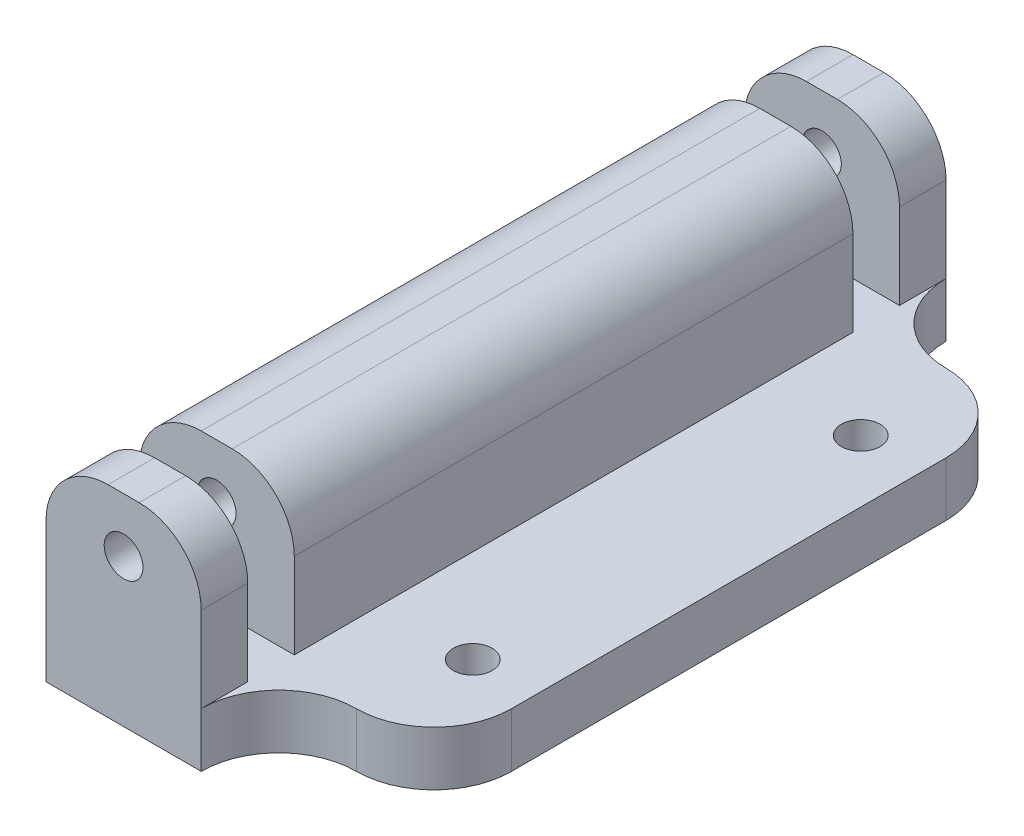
ISO-10303-21;
HEADER;
FILE_DESCRIPTION(('STEP AP214'),'2;1');
FILE_NAME('part.step','',(''),(''),'','','');
FILE_SCHEMA(('AUTOMOTIVE_DESIGN { 1 0 10303 214 1 1 1 1 }'));
ENDSEC;
DATA;
#1=APPLICATION_CONTEXT('core data for automotive mechanical design processes');
#2=APPLICATION_PROTOCOL_DEFINITION('international standard','automotive_design',2000,#1);
#3=PRODUCT_CONTEXT('',#1,'mechanical');
#4=PRODUCT('Part','Part','',(#3));
#5=PRODUCT_RELATED_PRODUCT_CATEGORY('part','',(#4));
#6=PRODUCT_DEFINITION_FORMATION('','',#4);
#7=PRODUCT_DEFINITION_CONTEXT('part definition',#1,'design');
#8=PRODUCT_DEFINITION('design','',#6,#7);
#9=PRODUCT_DEFINITION_SHAPE('','',#8);
#10=(LENGTH_UNIT() NAMED_UNIT(*) SI_UNIT(.MILLI.,.METRE.));
#11=(NAMED_UNIT(*) PLANE_ANGLE_UNIT() SI_UNIT($,.RADIAN.));
#12=(NAMED_UNIT(*) SI_UNIT($,.STERADIAN.) SOLID_ANGLE_UNIT());
#13=UNCERTAINTY_MEASURE_WITH_UNIT(LENGTH_MEASURE(1.E-05),#10,'distance_accuracy_value','');
#14=(GEOMETRIC_REPRESENTATION_CONTEXT(3) GLOBAL_UNCERTAINTY_ASSIGNED_CONTEXT((#13)) GLOBAL_UNIT_ASSIGNED_CONTEXT((#10,
#11,#12)) REPRESENTATION_CONTEXT('',''));
#15=CARTESIAN_POINT('',(0.,0.,0.));
#16=DIRECTION('',(0.,0.,1.));
#17=DIRECTION('',(1.,0.,0.));
#18=AXIS2_PLACEMENT_3D('',#15,#16,#17);
#19=CARTESIAN_POINT('',(6.,9.,48.));
#20=DIRECTION('',(0.,0.,-1.));
#21=DIRECTION('',(-1.,0.,0.));
#22=AXIS2_PLACEMENT_3D('',#19,#20,#21);
#23=PLANE('',#22);
#24=DIRECTION('',(1.,0.,0.));
#25=VECTOR('',#24,1.);
#26=CARTESIAN_POINT('',(0.,0.,48.));
#27=LINE('',#26,#25);
#28=CARTESIAN_POINT('',(0.,0.,48.));
#29=VERTEX_POINT('',#28);
#30=CARTESIAN_POINT('',(10.,0.,48.));
#31=VERTEX_POINT('',#30);
#32=EDGE_CURVE('E280',#29,#31,#27,.T.);
#33=ORIENTED_EDGE('',*,*,#32,.T.);
#34=DIRECTION('',(0.,1.,0.));
#35=VECTOR('',#34,1.);
#36=CARTESIAN_POINT('',(10.,3.5,48.));
#37=LINE('',#36,#35);
#38=CARTESIAN_POINT('',(10.,3.5,48.));
#39=VERTEX_POINT('',#38);
#40=EDGE_CURVE('E285',#31,#39,#37,.T.);
#41=ORIENTED_EDGE('',*,*,#40,.T.);
#42=CARTESIAN_POINT('',(10.,9.,48.));
#43=VERTEX_POINT('',#42);
#44=EDGE_CURVE('E284',#39,#43,#37,.T.);
#45=ORIENTED_EDGE('',*,*,#44,.T.);
#46=CARTESIAN_POINT('',(6.,9.,48.));
#47=DIRECTION('',(0.,0.,1.));
#48=DIRECTION('',(-1.,0.,0.));
#49=AXIS2_PLACEMENT_3D('',#46,#47,#48);
#50=CIRCLE('',#49,4.);
#51=CARTESIAN_POINT('',(6.,13.,48.));
#52=VERTEX_POINT('',#51);
#53=EDGE_CURVE('E288',#43,#52,#50,.T.);
#54=ORIENTED_EDGE('',*,*,#53,.T.);
#55=DIRECTION('',(-1.,0.,0.));
#56=VECTOR('',#55,1.);
#57=CARTESIAN_POINT('',(6.,13.,48.));
#58=LINE('',#57,#56);
#59=CARTESIAN_POINT('',(4.,13.,48.));
#60=VERTEX_POINT('',#59);
#61=EDGE_CURVE('E290',#52,#60,#58,.T.);
#62=ORIENTED_EDGE('',*,*,#61,.T.);
#63=CARTESIAN_POINT('',(4.,9.,48.));
#64=DIRECTION('',(0.,0.,1.));
#65=DIRECTION('',(-1.,0.,0.));
#66=AXIS2_PLACEMENT_3D('',#63,#64,#65);
#67=CIRCLE('',#66,4.);
#68=CARTESIAN_POINT('',(0.,9.,48.));
#69=VERTEX_POINT('',#68);
#70=EDGE_CURVE('E292',#60,#69,#67,.T.);
#71=ORIENTED_EDGE('',*,*,#70,.T.);
#72=DIRECTION('',(0.,-1.,0.));
#73=VECTOR('',#72,1.);
#74=CARTESIAN_POINT('',(0.,9.,48.));
#75=LINE('',#74,#73);
#76=EDGE_CURVE('E277',#69,#29,#75,.T.);
#77=ORIENTED_EDGE('',*,*,#76,.T.);
#78=EDGE_LOOP('',(#33,#41,#45,#54,#62,#71,#77));
#79=FACE_BOUND('',#78,.T.);
#80=CARTESIAN_POINT('',(5.,9.5,48.));
#81=DIRECTION('',(0.,0.,1.));
#82=DIRECTION('',(1.,0.,0.));
#83=AXIS2_PLACEMENT_3D('',#80,#81,#82);
#84=CIRCLE('',#83,1.24999999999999);
#85=CARTESIAN_POINT('',(6.24999999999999,9.5,48.));
#86=VERTEX_POINT('',#85);
#87=EDGE_CURVE('E382',#86,#86,#84,.T.);
#88=ORIENTED_EDGE('',*,*,#87,.F.);
#89=EDGE_LOOP('',(#88));
#90=FACE_BOUND('',#89,.T.);
#91=ADVANCED_FACE('F39',(#79,#90),#23,.F.);
#92=CARTESIAN_POINT('',(10.,3.5,48.));
#93=DIRECTION('',(-1.,0.,0.));
#94=DIRECTION('',(0.,-1.,0.));
#95=AXIS2_PLACEMENT_3D('',#92,#93,#94);
#96=PLANE('',#95);
#97=DIRECTION('',(0.,0.,-1.));
#98=VECTOR('',#97,1.);
#99=CARTESIAN_POINT('',(10.,3.5,48.));
#100=LINE('',#99,#98);
#101=CARTESIAN_POINT('',(10.,3.5,45.));
#102=VERTEX_POINT('',#101);
#103=EDGE_CURVE('E332',#39,#102,#100,.T.);
#104=ORIENTED_EDGE('',*,*,#103,.T.);
#105=DIRECTION('',(0.,1.,0.));
#106=VECTOR('',#105,1.);
#107=CARTESIAN_POINT('',(10.,3.5,45.));
#108=LINE('',#107,#106);
#109=CARTESIAN_POINT('',(10.,9.,45.));
#110=VERTEX_POINT('',#109);
#111=EDGE_CURVE('E238',#102,#110,#108,.T.);
#112=ORIENTED_EDGE('',*,*,#111,.T.);
#113=DIRECTION('',(0.,0.,-1.));
#114=VECTOR('',#113,1.);
#115=CARTESIAN_POINT('',(10.,9.,48.));
#116=LINE('',#115,#114);
#117=EDGE_CURVE('E327',#43,#110,#116,.T.);
#118=ORIENTED_EDGE('',*,*,#117,.F.);
#119=ORIENTED_EDGE('',*,*,#44,.F.);
#120=EDGE_LOOP('',(#104,#112,#118,#119));
#121=FACE_BOUND('',#120,.T.);
#122=ADVANCED_FACE('F420',(#121),#96,.F.);
#123=CARTESIAN_POINT('',(6.,9.,48.));
#124=DIRECTION('',(0.,0.,-1.));
#125=DIRECTION('',(-1.,0.,0.));
#126=AXIS2_PLACEMENT_3D('',#123,#124,#125);
#127=CYLINDRICAL_SURFACE('',#126,4.);
#128=ORIENTED_EDGE('',*,*,#117,.T.);
#129=CARTESIAN_POINT('',(6.,9.,45.));
#130=DIRECTION('',(0.,0.,1.));
#131=DIRECTION('',(1.,0.,0.));
#132=AXIS2_PLACEMENT_3D('',#129,#130,#131);
#133=CIRCLE('',#132,4.);
#134=CARTESIAN_POINT('',(6.,13.,45.));
#135=VERTEX_POINT('',#134);
#136=EDGE_CURVE('E235',#110,#135,#133,.T.);
#137=ORIENTED_EDGE('',*,*,#136,.T.);
#138=DIRECTION('',(0.,0.,-1.));
#139=VECTOR('',#138,1.);
#140=CARTESIAN_POINT('',(6.,13.,48.));
#141=LINE('',#140,#139);
#142=EDGE_CURVE('E322',#52,#135,#141,.T.);
#143=ORIENTED_EDGE('',*,*,#142,.F.);
#144=ORIENTED_EDGE('',*,*,#53,.F.);
#145=EDGE_LOOP('',(#128,#137,#143,#144));
#146=FACE_BOUND('',#145,.T.);
#147=ADVANCED_FACE('F426',(#146),#127,.T.);
#148=CARTESIAN_POINT('',(6.,13.,48.));
#149=DIRECTION('',(0.,-1.,0.));
#150=DIRECTION('',(0.,0.,-1.));
#151=AXIS2_PLACEMENT_3D('',#148,#149,#150);
#152=PLANE('',#151);
#153=ORIENTED_EDGE('',*,*,#142,.T.);
#154=DIRECTION('',(-1.,0.,0.));
#155=VECTOR('',#154,1.);
#156=CARTESIAN_POINT('',(60.,13.,45.));
#157=LINE('',#156,#155);
#158=CARTESIAN_POINT('',(4.,13.,45.));
#159=VERTEX_POINT('',#158);
#160=EDGE_CURVE('E221',#135,#159,#157,.T.);
#161=ORIENTED_EDGE('',*,*,#160,.T.);
#162=DIRECTION('',(0.,0.,-1.));
#163=VECTOR('',#162,1.);
#164=CARTESIAN_POINT('',(4.,13.,48.));
#165=LINE('',#164,#163);
#166=EDGE_CURVE('E317',#60,#159,#165,.T.);
#167=ORIENTED_EDGE('',*,*,#166,.F.);
#168=ORIENTED_EDGE('',*,*,#61,.F.);
#169=EDGE_LOOP('',(#153,#161,#167,#168));
#170=FACE_BOUND('',#169,.T.);
#171=ADVANCED_FACE('F451',(#170),#152,.F.);
#172=CARTESIAN_POINT('',(4.,9.,48.));
#173=DIRECTION('',(0.,0.,-1.));
#174=DIRECTION('',(-1.,0.,0.));
#175=AXIS2_PLACEMENT_3D('',#172,#173,#174);
#176=CYLINDRICAL_SURFACE('',#175,4.);
#177=ORIENTED_EDGE('',*,*,#166,.T.);
#178=CARTESIAN_POINT('',(4.,9.,45.));
#179=DIRECTION('',(0.,0.,1.));
#180=DIRECTION('',(1.,0.,0.));
#181=AXIS2_PLACEMENT_3D('',#178,#179,#180);
#182=CIRCLE('',#181,4.);
#183=CARTESIAN_POINT('',(0.,9.,45.));
#184=VERTEX_POINT('',#183);
#185=EDGE_CURVE('E232',#159,#184,#182,.T.);
#186=ORIENTED_EDGE('',*,*,#185,.T.);
#187=DIRECTION('',(0.,0.,-1.));
#188=VECTOR('',#187,1.);
#189=CARTESIAN_POINT('',(0.,9.,48.));
#190=LINE('',#189,#188);
#191=EDGE_CURVE('E314',#69,#184,#190,.T.);
#192=ORIENTED_EDGE('',*,*,#191,.F.);
#193=ORIENTED_EDGE('',*,*,#70,.F.);
#194=EDGE_LOOP('',(#177,#186,#192,#193));
#195=FACE_BOUND('',#194,.T.);
#196=ADVANCED_FACE('F445',(#195),#176,.T.);
#197=CARTESIAN_POINT('',(10.,9.,3.));
#198=VERTEX_POINT('',#197);
#199=CARTESIAN_POINT('',(10.,9.,0.));
#200=VERTEX_POINT('',#199);
#201=EDGE_CURVE('E325',#198,#200,#116,.T.);
#202=ORIENTED_EDGE('',*,*,#201,.F.);
#203=DIRECTION('',(0.,-1.,0.));
#204=VECTOR('',#203,1.);
#205=CARTESIAN_POINT('',(10.,3.50000000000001,3.));
#206=LINE('',#205,#204);
#207=CARTESIAN_POINT('',(10.,3.5,3.));
#208=VERTEX_POINT('',#207);
#209=EDGE_CURVE('E273',#198,#208,#206,.T.);
#210=ORIENTED_EDGE('',*,*,#209,.T.);
#211=CARTESIAN_POINT('',(10.,3.5,0.));
#212=VERTEX_POINT('',#211);
#213=EDGE_CURVE('E330',#208,#212,#100,.T.);
#214=ORIENTED_EDGE('',*,*,#213,.T.);
#215=DIRECTION('',(0.,1.,0.));
#216=VECTOR('',#215,1.);
#217=CARTESIAN_POINT('',(10.,3.5,0.));
#218=LINE('',#217,#216);
#219=EDGE_CURVE('E302',#212,#200,#218,.T.);
#220=ORIENTED_EDGE('',*,*,#219,.T.);
#221=EDGE_LOOP('',(#202,#210,#214,#220));
#222=FACE_BOUND('',#221,.T.);
#223=ADVANCED_FACE('F429',(#222),#96,.F.);
#224=CARTESIAN_POINT('',(6.,13.,3.));
#225=VERTEX_POINT('',#224);
#226=CARTESIAN_POINT('',(6.,13.,0.));
#227=VERTEX_POINT('',#226);
#228=EDGE_CURVE('E320',#225,#227,#141,.T.);
#229=ORIENTED_EDGE('',*,*,#228,.F.);
#230=CARTESIAN_POINT('',(6.,9.,3.));
#231=DIRECTION('',(0.,0.,-1.));
#232=DIRECTION('',(0.,1.,0.));
#233=AXIS2_PLACEMENT_3D('',#230,#231,#232);
#234=CIRCLE('',#233,4.);
#235=EDGE_CURVE('E270',#225,#198,#234,.T.);
#236=ORIENTED_EDGE('',*,*,#235,.T.);
#237=ORIENTED_EDGE('',*,*,#201,.T.);
#238=CARTESIAN_POINT('',(6.,9.,0.));
#239=DIRECTION('',(0.,0.,1.));
#240=DIRECTION('',(-1.,0.,0.));
#241=AXIS2_PLACEMENT_3D('',#238,#239,#240);
#242=CIRCLE('',#241,4.);
#243=EDGE_CURVE('E306',#200,#227,#242,.T.);
#244=ORIENTED_EDGE('',*,*,#243,.T.);
#245=EDGE_LOOP('',(#229,#236,#237,#244));
#246=FACE_BOUND('',#245,.T.);
#247=ADVANCED_FACE('F455',(#246),#127,.T.);
#248=CARTESIAN_POINT('',(4.,13.,3.));
#249=VERTEX_POINT('',#248);
#250=CARTESIAN_POINT('',(4.,13.,0.));
#251=VERTEX_POINT('',#250);
#252=EDGE_CURVE('E316',#249,#251,#165,.T.);
#253=ORIENTED_EDGE('',*,*,#252,.F.);
#254=DIRECTION('',(-1.,0.,0.));
#255=VECTOR('',#254,1.);
#256=CARTESIAN_POINT('',(60.,13.,3.));
#257=LINE('',#256,#255);
#258=EDGE_CURVE('E249',#225,#249,#257,.T.);
#259=ORIENTED_EDGE('',*,*,#258,.F.);
#260=ORIENTED_EDGE('',*,*,#228,.T.);
#261=DIRECTION('',(-1.,0.,0.));
#262=VECTOR('',#261,1.);
#263=CARTESIAN_POINT('',(6.,13.,0.));
#264=LINE('',#263,#262);
#265=EDGE_CURVE('E309',#227,#251,#264,.T.);
#266=ORIENTED_EDGE('',*,*,#265,.T.);
#267=EDGE_LOOP('',(#253,#259,#260,#266));
#268=FACE_BOUND('',#267,.T.);
#269=ADVANCED_FACE('F452',(#268),#152,.F.);
#270=CARTESIAN_POINT('',(0.,9.,3.));
#271=VERTEX_POINT('',#270);
#272=CARTESIAN_POINT('',(0.,9.,0.));
#273=VERTEX_POINT('',#272);
#274=EDGE_CURVE('E294',#271,#273,#190,.T.);
#275=ORIENTED_EDGE('',*,*,#274,.F.);
#276=CARTESIAN_POINT('',(4.,9.,3.));
#277=DIRECTION('',(0.,0.,-1.));
#278=DIRECTION('',(0.,1.,0.));
#279=AXIS2_PLACEMENT_3D('',#276,#277,#278);
#280=CIRCLE('',#279,4.);
#281=EDGE_CURVE('E267',#271,#249,#280,.T.);
#282=ORIENTED_EDGE('',*,*,#281,.T.);
#283=ORIENTED_EDGE('',*,*,#252,.T.);
#284=CARTESIAN_POINT('',(4.,9.,0.));
#285=DIRECTION('',(0.,0.,1.));
#286=DIRECTION('',(-1.,0.,0.));
#287=AXIS2_PLACEMENT_3D('',#284,#285,#286);
#288=CIRCLE('',#287,4.);
#289=EDGE_CURVE('E281',#251,#273,#288,.T.);
#290=ORIENTED_EDGE('',*,*,#289,.T.);
#291=EDGE_LOOP('',(#275,#282,#283,#290));
#292=FACE_BOUND('',#291,.T.);
#293=ADVANCED_FACE('F446',(#292),#176,.T.);
#294=CARTESIAN_POINT('',(0.,9.,48.));
#295=DIRECTION('',(1.,0.,0.));
#296=DIRECTION('',(0.,0.,-1.));
#297=AXIS2_PLACEMENT_3D('',#294,#295,#296);
#298=PLANE('',#297);
#299=ORIENTED_EDGE('',*,*,#191,.T.);
#300=DIRECTION('',(0.,1.,0.));
#301=VECTOR('',#300,1.);
#302=CARTESIAN_POINT('',(0.,13.,45.));
#303=LINE('',#302,#301);
#304=CARTESIAN_POINT('',(0.,3.5,45.));
#305=VERTEX_POINT('',#304);
#306=EDGE_CURVE('E216',#305,#184,#303,.T.);
#307=ORIENTED_EDGE('',*,*,#306,.F.);
#308=DIRECTION('',(0.,0.,1.));
#309=VECTOR('',#308,1.);
#310=CARTESIAN_POINT('',(0.,3.5,45.));
#311=LINE('',#310,#309);
#312=CARTESIAN_POINT('',(0.,3.5,42.));
#313=VERTEX_POINT('',#312);
#314=EDGE_CURVE('E201',#313,#305,#311,.T.);
#315=ORIENTED_EDGE('',*,*,#314,.F.);
#316=DIRECTION('',(0.,-1.,0.));
#317=VECTOR('',#316,1.);
#318=CARTESIAN_POINT('',(0.,13.,42.));
#319=LINE('',#318,#317);
#320=CARTESIAN_POINT('',(0.,9.,42.));
#321=VERTEX_POINT('',#320);
#322=EDGE_CURVE('E194',#321,#313,#319,.T.);
#323=ORIENTED_EDGE('',*,*,#322,.F.);
#324=CARTESIAN_POINT('',(0.,9.,6.00000000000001));
#325=VERTEX_POINT('',#324);
#326=EDGE_CURVE('E64',#321,#325,#190,.T.);
#327=ORIENTED_EDGE('',*,*,#326,.T.);
#328=DIRECTION('',(0.,1.,0.));
#329=VECTOR('',#328,1.);
#330=CARTESIAN_POINT('',(0.,13.,6.));
#331=LINE('',#330,#329);
#332=CARTESIAN_POINT('',(0.,3.5,6.));
#333=VERTEX_POINT('',#332);
#334=EDGE_CURVE('E246',#333,#325,#331,.T.);
#335=ORIENTED_EDGE('',*,*,#334,.F.);
#336=DIRECTION('',(0.,0.,1.));
#337=VECTOR('',#336,1.);
#338=CARTESIAN_POINT('',(0.,3.5,3.));
#339=LINE('',#338,#337);
#340=CARTESIAN_POINT('',(0.,3.5,3.));
#341=VERTEX_POINT('',#340);
#342=EDGE_CURVE('E243',#341,#333,#339,.T.);
#343=ORIENTED_EDGE('',*,*,#342,.F.);
#344=DIRECTION('',(0.,-1.,0.));
#345=VECTOR('',#344,1.);
#346=CARTESIAN_POINT('',(0.,13.,3.));
#347=LINE('',#346,#345);
#348=EDGE_CURVE('E241',#271,#341,#347,.T.);
#349=ORIENTED_EDGE('',*,*,#348,.F.);
#350=ORIENTED_EDGE('',*,*,#274,.T.);
#351=DIRECTION('',(0.,-1.,0.));
#352=VECTOR('',#351,1.);
#353=CARTESIAN_POINT('',(0.,9.,0.));
#354=LINE('',#353,#352);
#355=CARTESIAN_POINT('',(0.,0.,0.));
#356=VERTEX_POINT('',#355);
#357=EDGE_CURVE('E295',#273,#356,#354,.T.);
#358=ORIENTED_EDGE('',*,*,#357,.T.);
#359=DIRECTION('',(0.,0.,-1.));
#360=VECTOR('',#359,1.);
#361=CARTESIAN_POINT('',(0.,0.,48.));
#362=LINE('',#361,#360);
#363=EDGE_CURVE('E341',#29,#356,#362,.T.);
#364=ORIENTED_EDGE('',*,*,#363,.F.);
#365=ORIENTED_EDGE('',*,*,#76,.F.);
#366=EDGE_LOOP('',(#299,#307,#315,#323,#327,#335,#343,#349,#350,#358,#364,#365));
#367=FACE_BOUND('',#366,.T.);
#368=ADVANCED_FACE('F215',(#367),#298,.F.);
#369=CARTESIAN_POINT('',(0.,0.,48.));
#370=DIRECTION('',(0.,1.,0.));
#371=DIRECTION('',(0.,0.,1.));
#372=AXIS2_PLACEMENT_3D('',#369,#370,#371);
#373=PLANE('',#372);
#374=CARTESIAN_POINT('',(16.,0.,36.5));
#375=DIRECTION('',(0.,1.,0.));
#376=DIRECTION('',(0.,0.,1.));
#377=AXIS2_PLACEMENT_3D('',#374,#375,#376);
#378=CIRCLE('',#377,1.25);
#379=CARTESIAN_POINT('',(16.,0.,37.75));
#380=VERTEX_POINT('',#379);
#381=EDGE_CURVE('E786',#380,#380,#378,.T.);
#382=ORIENTED_EDGE('',*,*,#381,.T.);
#383=EDGE_LOOP('',(#382));
#384=FACE_BOUND('',#383,.T.);
#385=CARTESIAN_POINT('',(16.,0.,11.5));
#386=DIRECTION('',(0.,1.,0.));
#387=DIRECTION('',(0.,0.,1.));
#388=AXIS2_PLACEMENT_3D('',#385,#386,#387);
#389=CIRCLE('',#388,1.25);
#390=CARTESIAN_POINT('',(16.,0.,12.75));
#391=VERTEX_POINT('',#390);
#392=EDGE_CURVE('E387',#391,#391,#389,.T.);
#393=ORIENTED_EDGE('',*,*,#392,.T.);
#394=EDGE_LOOP('',(#393));
#395=FACE_BOUND('',#394,.T.);
#396=DIRECTION('',(0.,0.,-1.));
#397=VECTOR('',#396,1.);
#398=CARTESIAN_POINT('',(20.,0.,48.));
#399=LINE('',#398,#397);
#400=CARTESIAN_POINT('',(20.,0.,38.));
#401=VERTEX_POINT('',#400);
#402=CARTESIAN_POINT('',(20.,0.,9.99999999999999));
#403=VERTEX_POINT('',#402);
#404=EDGE_CURVE('E338',#401,#403,#399,.T.);
#405=ORIENTED_EDGE('',*,*,#404,.F.);
#406=CARTESIAN_POINT('',(15.,0.,38.));
#407=DIRECTION('',(0.,1.,0.));
#408=DIRECTION('',(0.,0.,1.));
#409=AXIS2_PLACEMENT_3D('',#406,#407,#408);
#410=CIRCLE('',#409,5.);
#411=CARTESIAN_POINT('',(15.,0.,43.));
#412=VERTEX_POINT('',#411);
#413=EDGE_CURVE('E356',#401,#412,#410,.F.);
#414=ORIENTED_EDGE('',*,*,#413,.T.);
#415=CARTESIAN_POINT('',(15.,0.,48.));
#416=DIRECTION('',(0.,1.,0.));
#417=DIRECTION('',(0.,0.,1.));
#418=AXIS2_PLACEMENT_3D('',#415,#416,#417);
#419=CIRCLE('',#418,5.);
#420=EDGE_CURVE('E360',#412,#31,#419,.T.);
#421=ORIENTED_EDGE('',*,*,#420,.T.);
#422=ORIENTED_EDGE('',*,*,#32,.F.);
#423=ORIENTED_EDGE('',*,*,#363,.T.);
#424=DIRECTION('',(1.,0.,0.));
#425=VECTOR('',#424,1.);
#426=CARTESIAN_POINT('',(0.,0.,0.));
#427=LINE('',#426,#425);
#428=CARTESIAN_POINT('',(10.,0.,0.));
#429=VERTEX_POINT('',#428);
#430=EDGE_CURVE('E298',#356,#429,#427,.T.);
#431=ORIENTED_EDGE('',*,*,#430,.T.);
#432=CARTESIAN_POINT('',(15.,0.,0.));
#433=DIRECTION('',(0.,1.,0.));
#434=DIRECTION('',(0.,0.,1.));
#435=AXIS2_PLACEMENT_3D('',#432,#433,#434);
#436=CIRCLE('',#435,5.);
#437=CARTESIAN_POINT('',(15.,0.,5.));
#438=VERTEX_POINT('',#437);
#439=EDGE_CURVE('E12',#429,#438,#436,.T.);
#440=ORIENTED_EDGE('',*,*,#439,.T.);
#441=CARTESIAN_POINT('',(15.,0.,9.99999999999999));
#442=DIRECTION('',(0.,1.,0.));
#443=DIRECTION('',(0.,0.,1.));
#444=AXIS2_PLACEMENT_3D('',#441,#442,#443);
#445=CIRCLE('',#444,5.);
#446=EDGE_CURVE('E354',#438,#403,#445,.F.);
#447=ORIENTED_EDGE('',*,*,#446,.T.);
#448=EDGE_LOOP('',(#405,#414,#421,#422,#423,#431,#440,#447));
#449=FACE_BOUND('',#448,.T.);
#450=ADVANCED_FACE('F465',(#384,#395,#449),#373,.F.);
#451=CARTESIAN_POINT('',(20.,0.,48.));
#452=DIRECTION('',(-1.,0.,0.));
#453=DIRECTION('',(0.,0.,1.));
#454=AXIS2_PLACEMENT_3D('',#451,#452,#453);
#455=PLANE('',#454);
#456=DIRECTION('',(0.,0.,-1.));
#457=VECTOR('',#456,1.);
#458=CARTESIAN_POINT('',(20.,3.5,48.));
#459=LINE('',#458,#457);
#460=CARTESIAN_POINT('',(20.,3.5,38.));
#461=VERTEX_POINT('',#460);
#462=CARTESIAN_POINT('',(20.,3.5,9.99999999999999));
#463=VERTEX_POINT('',#462);
#464=EDGE_CURVE('E335',#461,#463,#459,.T.);
#465=ORIENTED_EDGE('',*,*,#464,.F.);
#466=DIRECTION('',(0.,1.,0.));
#467=VECTOR('',#466,1.);
#468=CARTESIAN_POINT('',(20.,0.,38.));
#469=LINE('',#468,#467);
#470=EDGE_CURVE('E351',#461,#401,#469,.F.);
#471=ORIENTED_EDGE('',*,*,#470,.T.);
#472=ORIENTED_EDGE('',*,*,#404,.T.);
#473=DIRECTION('',(0.,1.,0.));
#474=VECTOR('',#473,1.);
#475=CARTESIAN_POINT('',(20.,0.,9.99999999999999));
#476=LINE('',#475,#474);
#477=EDGE_CURVE('E348',#403,#463,#476,.T.);
#478=ORIENTED_EDGE('',*,*,#477,.T.);
#479=EDGE_LOOP('',(#465,#471,#472,#478));
#480=FACE_BOUND('',#479,.T.);
#481=ADVANCED_FACE('F461',(#480),#455,.F.);
#482=CARTESIAN_POINT('',(20.,3.5,48.));
#483=DIRECTION('',(0.,-1.,0.));
#484=DIRECTION('',(1.,0.,0.));
#485=AXIS2_PLACEMENT_3D('',#482,#483,#484);
#486=PLANE('',#485);
#487=CARTESIAN_POINT('',(16.,3.5,36.5));
#488=DIRECTION('',(0.,1.,0.));
#489=DIRECTION('',(0.,0.,1.));
#490=AXIS2_PLACEMENT_3D('',#487,#488,#489);
#491=CIRCLE('',#490,1.24999999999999);
#492=CARTESIAN_POINT('',(16.,3.5,37.75));
#493=VERTEX_POINT('',#492);
#494=EDGE_CURVE('E789',#493,#493,#491,.T.);
#495=ORIENTED_EDGE('',*,*,#494,.F.);
#496=EDGE_LOOP('',(#495));
#497=FACE_BOUND('',#496,.T.);
#498=CARTESIAN_POINT('',(16.,3.5,11.5));
#499=DIRECTION('',(0.,1.,0.));
#500=DIRECTION('',(0.,0.,1.));
#501=AXIS2_PLACEMENT_3D('',#498,#499,#500);
#502=CIRCLE('',#501,1.24999999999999);
#503=CARTESIAN_POINT('',(16.,3.5,12.75));
#504=VERTEX_POINT('',#503);
#505=EDGE_CURVE('E791',#504,#504,#502,.T.);
#506=ORIENTED_EDGE('',*,*,#505,.F.);
#507=EDGE_LOOP('',(#506));
#508=FACE_BOUND('',#507,.T.);
#509=CARTESIAN_POINT('',(10.,3.5,42.));
#510=VERTEX_POINT('',#509);
#511=CARTESIAN_POINT('',(10.,3.5,6.));
#512=VERTEX_POINT('',#511);
#513=EDGE_CURVE('E211',#510,#512,#100,.T.);
#514=ORIENTED_EDGE('',*,*,#513,.F.);
#515=DIRECTION('',(-1.,0.,0.));
#516=VECTOR('',#515,1.);
#517=CARTESIAN_POINT('',(60.,3.5,42.));
#518=LINE('',#517,#516);
#519=EDGE_CURVE('E197',#510,#313,#518,.T.);
#520=ORIENTED_EDGE('',*,*,#519,.T.);
#521=ORIENTED_EDGE('',*,*,#314,.T.);
#522=DIRECTION('',(-1.,0.,0.));
#523=VECTOR('',#522,1.);
#524=CARTESIAN_POINT('',(60.,3.5,45.));
#525=LINE('',#524,#523);
#526=EDGE_CURVE('E212',#102,#305,#525,.T.);
#527=ORIENTED_EDGE('',*,*,#526,.F.);
#528=ORIENTED_EDGE('',*,*,#103,.F.);
#529=CARTESIAN_POINT('',(15.,3.5,48.));
#530=DIRECTION('',(0.,-1.,0.));
#531=DIRECTION('',(1.,0.,0.));
#532=AXIS2_PLACEMENT_3D('',#529,#530,#531);
#533=CIRCLE('',#532,5.);
#534=CARTESIAN_POINT('',(15.,3.5,43.));
#535=VERTEX_POINT('',#534);
#536=EDGE_CURVE('E358',#39,#535,#533,.T.);
#537=ORIENTED_EDGE('',*,*,#536,.T.);
#538=CARTESIAN_POINT('',(15.,3.5,38.));
#539=DIRECTION('',(0.,-1.,0.));
#540=DIRECTION('',(1.,0.,0.));
#541=AXIS2_PLACEMENT_3D('',#538,#539,#540);
#542=CIRCLE('',#541,5.);
#543=EDGE_CURVE('E346',#535,#461,#542,.F.);
#544=ORIENTED_EDGE('',*,*,#543,.T.);
#545=ORIENTED_EDGE('',*,*,#464,.T.);
#546=CARTESIAN_POINT('',(15.,3.5,9.99999999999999));
#547=DIRECTION('',(0.,-1.,0.));
#548=DIRECTION('',(1.,0.,0.));
#549=AXIS2_PLACEMENT_3D('',#546,#547,#548);
#550=CIRCLE('',#549,5.);
#551=CARTESIAN_POINT('',(15.,3.5,5.));
#552=VERTEX_POINT('',#551);
#553=EDGE_CURVE('E344',#463,#552,#550,.F.);
#554=ORIENTED_EDGE('',*,*,#553,.T.);
#555=CARTESIAN_POINT('',(15.,3.5,0.));
#556=DIRECTION('',(0.,-1.,0.));
#557=DIRECTION('',(1.,0.,0.));
#558=AXIS2_PLACEMENT_3D('',#555,#556,#557);
#559=CIRCLE('',#558,5.);
#560=EDGE_CURVE('E48',#552,#212,#559,.T.);
#561=ORIENTED_EDGE('',*,*,#560,.T.);
#562=ORIENTED_EDGE('',*,*,#213,.F.);
#563=DIRECTION('',(-1.,0.,0.));
#564=VECTOR('',#563,1.);
#565=CARTESIAN_POINT('',(60.,3.5,3.));
#566=LINE('',#565,#564);
#567=EDGE_CURVE('E248',#208,#341,#566,.T.);
#568=ORIENTED_EDGE('',*,*,#567,.T.);
#569=ORIENTED_EDGE('',*,*,#342,.T.);
#570=DIRECTION('',(-1.,0.,0.));
#571=VECTOR('',#570,1.);
#572=CARTESIAN_POINT('',(60.,3.5,6.));
#573=LINE('',#572,#571);
#574=EDGE_CURVE('E255',#512,#333,#573,.T.);
#575=ORIENTED_EDGE('',*,*,#574,.F.);
#576=EDGE_LOOP('',(#514,#520,#521,#527,#528,#537,#544,#545,#554,#561,#562,#568,#569,#575));
#577=FACE_BOUND('',#576,.T.);
#578=ADVANCED_FACE('F207',(#497,#508,#577),#486,.F.);
#579=CARTESIAN_POINT('',(10.,9.,42.));
#580=VERTEX_POINT('',#579);
#581=CARTESIAN_POINT('',(10.,9.,6.00000000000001));
#582=VERTEX_POINT('',#581);
#583=EDGE_CURVE('E331',#580,#582,#116,.T.);
#584=ORIENTED_EDGE('',*,*,#583,.F.);
#585=DIRECTION('',(0.,-1.,0.));
#586=VECTOR('',#585,1.);
#587=CARTESIAN_POINT('',(10.,3.5,42.));
#588=LINE('',#587,#586);
#589=EDGE_CURVE('E230',#580,#510,#588,.T.);
#590=ORIENTED_EDGE('',*,*,#589,.T.);
#591=ORIENTED_EDGE('',*,*,#513,.T.);
#592=DIRECTION('',(0.,1.,0.));
#593=VECTOR('',#592,1.);
#594=CARTESIAN_POINT('',(10.,3.50000000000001,6.00000000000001));
#595=LINE('',#594,#593);
#596=EDGE_CURVE('E264',#512,#582,#595,.T.);
#597=ORIENTED_EDGE('',*,*,#596,.T.);
#598=EDGE_LOOP('',(#584,#590,#591,#597));
#599=FACE_BOUND('',#598,.T.);
#600=ADVANCED_FACE('F430',(#599),#96,.F.);
#601=CARTESIAN_POINT('',(6.,13.,42.));
#602=VERTEX_POINT('',#601);
#603=CARTESIAN_POINT('',(6.,13.,6.));
#604=VERTEX_POINT('',#603);
#605=EDGE_CURVE('E326',#602,#604,#141,.T.);
#606=ORIENTED_EDGE('',*,*,#605,.F.);
#607=CARTESIAN_POINT('',(6.,9.,42.));
#608=DIRECTION('',(0.,0.,-1.));
#609=DIRECTION('',(-1.,0.,0.));
#610=AXIS2_PLACEMENT_3D('',#607,#608,#609);
#611=CIRCLE('',#610,4.);
#612=EDGE_CURVE('E227',#602,#580,#611,.T.);
#613=ORIENTED_EDGE('',*,*,#612,.T.);
#614=ORIENTED_EDGE('',*,*,#583,.T.);
#615=CARTESIAN_POINT('',(6.,9.,6.00000000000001));
#616=DIRECTION('',(0.,0.,1.));
#617=DIRECTION('',(0.,-1.,0.));
#618=AXIS2_PLACEMENT_3D('',#615,#616,#617);
#619=CIRCLE('',#618,4.);
#620=EDGE_CURVE('E261',#582,#604,#619,.T.);
#621=ORIENTED_EDGE('',*,*,#620,.T.);
#622=EDGE_LOOP('',(#606,#613,#614,#621));
#623=FACE_BOUND('',#622,.T.);
#624=ADVANCED_FACE('F449',(#623),#127,.T.);
#625=CARTESIAN_POINT('',(4.,13.,42.));
#626=VERTEX_POINT('',#625);
#627=CARTESIAN_POINT('',(4.,13.,6.00000000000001));
#628=VERTEX_POINT('',#627);
#629=EDGE_CURVE('E321',#626,#628,#165,.T.);
#630=ORIENTED_EDGE('',*,*,#629,.F.);
#631=DIRECTION('',(-1.,0.,0.));
#632=VECTOR('',#631,1.);
#633=CARTESIAN_POINT('',(60.,13.,42.));
#634=LINE('',#633,#632);
#635=EDGE_CURVE('E56',#602,#626,#634,.T.);
#636=ORIENTED_EDGE('',*,*,#635,.F.);
#637=ORIENTED_EDGE('',*,*,#605,.T.);
#638=DIRECTION('',(-1.,0.,0.));
#639=VECTOR('',#638,1.);
#640=CARTESIAN_POINT('',(60.,13.,6.));
#641=LINE('',#640,#639);
#642=EDGE_CURVE('E252',#604,#628,#641,.T.);
#643=ORIENTED_EDGE('',*,*,#642,.T.);
#644=EDGE_LOOP('',(#630,#636,#637,#643));
#645=FACE_BOUND('',#644,.T.);
#646=ADVANCED_FACE('F443',(#645),#152,.F.);
#647=ORIENTED_EDGE('',*,*,#326,.F.);
#648=CARTESIAN_POINT('',(4.,9.,42.));
#649=DIRECTION('',(0.,0.,-1.));
#650=DIRECTION('',(-1.,0.,0.));
#651=AXIS2_PLACEMENT_3D('',#648,#649,#650);
#652=CIRCLE('',#651,4.);
#653=EDGE_CURVE('E199',#321,#626,#652,.T.);
#654=ORIENTED_EDGE('',*,*,#653,.T.);
#655=ORIENTED_EDGE('',*,*,#629,.T.);
#656=CARTESIAN_POINT('',(4.,9.,6.00000000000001));
#657=DIRECTION('',(0.,0.,1.));
#658=DIRECTION('',(0.,-1.,0.));
#659=AXIS2_PLACEMENT_3D('',#656,#657,#658);
#660=CIRCLE('',#659,4.);
#661=EDGE_CURVE('E251',#628,#325,#660,.T.);
#662=ORIENTED_EDGE('',*,*,#661,.T.);
#663=EDGE_LOOP('',(#647,#654,#655,#662));
#664=FACE_BOUND('',#663,.T.);
#665=ADVANCED_FACE('F439',(#664),#176,.T.);
#666=CARTESIAN_POINT('',(6.,9.,0.));
#667=DIRECTION('',(0.,0.,-1.));
#668=DIRECTION('',(-1.,0.,0.));
#669=AXIS2_PLACEMENT_3D('',#666,#667,#668);
#670=PLANE('',#669);
#671=CARTESIAN_POINT('',(5.,9.5,0.));
#672=DIRECTION('',(0.,0.,-1.));
#673=DIRECTION('',(-1.,0.,0.));
#674=AXIS2_PLACEMENT_3D('',#671,#672,#673);
#675=CIRCLE('',#674,1.25);
#676=CARTESIAN_POINT('',(3.75,9.5,0.));
#677=VERTEX_POINT('',#676);
#678=EDGE_CURVE('E391',#677,#677,#675,.T.);
#679=ORIENTED_EDGE('',*,*,#678,.F.);
#680=EDGE_LOOP('',(#679));
#681=FACE_BOUND('',#680,.T.);
#682=EDGE_CURVE('E303',#429,#212,#218,.T.);
#683=ORIENTED_EDGE('',*,*,#682,.F.);
#684=ORIENTED_EDGE('',*,*,#430,.F.);
#685=ORIENTED_EDGE('',*,*,#357,.F.);
#686=ORIENTED_EDGE('',*,*,#289,.F.);
#687=ORIENTED_EDGE('',*,*,#265,.F.);
#688=ORIENTED_EDGE('',*,*,#243,.F.);
#689=ORIENTED_EDGE('',*,*,#219,.F.);
#690=EDGE_LOOP('',(#683,#684,#685,#686,#687,#688,#689));
#691=FACE_BOUND('',#690,.T.);
#692=ADVANCED_FACE('F436',(#681,#691),#670,.T.);
#693=CARTESIAN_POINT('',(5.,9.5,60.));
#694=DIRECTION('',(0.,0.,-1.));
#695=DIRECTION('',(-1.,0.,0.));
#696=AXIS2_PLACEMENT_3D('',#693,#694,#695);
#697=CYLINDRICAL_SURFACE('',#696,1.);
#698=CARTESIAN_POINT('',(5.,9.5,33.));
#699=DIRECTION('',(0.,0.,-1.));
#700=DIRECTION('',(-1.,0.,0.));
#701=AXIS2_PLACEMENT_3D('',#698,#699,#700);
#702=CIRCLE('',#701,1.);
#703=CARTESIAN_POINT('',(4.,9.5,33.));
#704=VERTEX_POINT('',#703);
#705=EDGE_CURVE('E43',#704,#704,#702,.F.);
#706=ORIENTED_EDGE('',*,*,#705,.T.);
#707=EDGE_LOOP('',(#706));
#708=FACE_BOUND('',#707,.T.);
#709=CARTESIAN_POINT('',(5.,9.5,15.));
#710=DIRECTION('',(0.,0.,1.));
#711=DIRECTION('',(1.,0.,0.));
#712=AXIS2_PLACEMENT_3D('',#709,#710,#711);
#713=CIRCLE('',#712,1.);
#714=CARTESIAN_POINT('',(6.,9.5,15.));
#715=VERTEX_POINT('',#714);
#716=EDGE_CURVE('E202',#715,#715,#713,.F.);
#717=ORIENTED_EDGE('',*,*,#716,.T.);
#718=EDGE_LOOP('',(#717));
#719=FACE_BOUND('',#718,.T.);
#720=ADVANCED_FACE('F434',(#708,#719),#697,.F.);
#721=CARTESIAN_POINT('',(15.,3.5,48.));
#722=DIRECTION('',(0.,-1.,0.));
#723=DIRECTION('',(1.,0.,0.));
#724=AXIS2_PLACEMENT_3D('',#721,#722,#723);
#725=CYLINDRICAL_SURFACE('',#724,5.);
#726=ORIENTED_EDGE('',*,*,#40,.F.);
#727=ORIENTED_EDGE('',*,*,#420,.F.);
#728=DIRECTION('',(0.,1.,0.));
#729=VECTOR('',#728,1.);
#730=CARTESIAN_POINT('',(15.,0.,43.));
#731=LINE('',#730,#729);
#732=EDGE_CURVE('E299',#535,#412,#731,.F.);
#733=ORIENTED_EDGE('',*,*,#732,.F.);
#734=ORIENTED_EDGE('',*,*,#536,.F.);
#735=EDGE_LOOP('',(#726,#727,#733,#734));
#736=FACE_BOUND('',#735,.T.);
#737=ADVANCED_FACE('F475',(#736),#725,.F.);
#738=CARTESIAN_POINT('',(15.,-56.5,38.));
#739=DIRECTION('',(0.,1.,0.));
#740=DIRECTION('',(0.,0.,1.));
#741=AXIS2_PLACEMENT_3D('',#738,#739,#740);
#742=CYLINDRICAL_SURFACE('',#741,5.);
#743=ORIENTED_EDGE('',*,*,#413,.F.);
#744=ORIENTED_EDGE('',*,*,#470,.F.);
#745=ORIENTED_EDGE('',*,*,#543,.F.);
#746=ORIENTED_EDGE('',*,*,#732,.T.);
#747=EDGE_LOOP('',(#743,#744,#745,#746));
#748=FACE_BOUND('',#747,.T.);
#749=ADVANCED_FACE('F472',(#748),#742,.T.);
#750=CARTESIAN_POINT('',(15.,-56.5,0.));
#751=DIRECTION('',(0.,-1.,0.));
#752=DIRECTION('',(1.,0.,0.));
#753=AXIS2_PLACEMENT_3D('',#750,#751,#752);
#754=CYLINDRICAL_SURFACE('',#753,5.);
#755=DIRECTION('',(0.,1.,0.));
#756=VECTOR('',#755,1.);
#757=CARTESIAN_POINT('',(15.,3.5,5.));
#758=LINE('',#757,#756);
#759=EDGE_CURVE('E276',#438,#552,#758,.T.);
#760=ORIENTED_EDGE('',*,*,#759,.F.);
#761=ORIENTED_EDGE('',*,*,#439,.F.);
#762=ORIENTED_EDGE('',*,*,#682,.T.);
#763=ORIENTED_EDGE('',*,*,#560,.F.);
#764=EDGE_LOOP('',(#760,#761,#762,#763));
#765=FACE_BOUND('',#764,.T.);
#766=ADVANCED_FACE('F41',(#765),#754,.F.);
#767=CARTESIAN_POINT('',(15.,0.,9.99999999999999));
#768=DIRECTION('',(0.,1.,0.));
#769=DIRECTION('',(0.,0.,1.));
#770=AXIS2_PLACEMENT_3D('',#767,#768,#769);
#771=CYLINDRICAL_SURFACE('',#770,5.);
#772=ORIENTED_EDGE('',*,*,#446,.F.);
#773=ORIENTED_EDGE('',*,*,#759,.T.);
#774=ORIENTED_EDGE('',*,*,#553,.F.);
#775=ORIENTED_EDGE('',*,*,#477,.F.);
#776=EDGE_LOOP('',(#772,#773,#774,#775));
#777=FACE_BOUND('',#776,.T.);
#778=ADVANCED_FACE('F479',(#777),#771,.T.);
#779=CARTESIAN_POINT('',(60.,13.,3.));
#780=DIRECTION('',(0.,0.,-1.));
#781=DIRECTION('',(0.,1.,0.));
#782=AXIS2_PLACEMENT_3D('',#779,#780,#781);
#783=PLANE('',#782);
#784=CARTESIAN_POINT('',(5.,9.5,3.));
#785=DIRECTION('',(0.,0.,-1.));
#786=DIRECTION('',(0.,1.,0.));
#787=AXIS2_PLACEMENT_3D('',#784,#785,#786);
#788=CIRCLE('',#787,1.25);
#789=CARTESIAN_POINT('',(5.,10.75,3.));
#790=VERTEX_POINT('',#789);
#791=EDGE_CURVE('E370',#790,#790,#788,.T.);
#792=ORIENTED_EDGE('',*,*,#791,.T.);
#793=EDGE_LOOP('',(#792));
#794=FACE_BOUND('',#793,.T.);
#795=ORIENTED_EDGE('',*,*,#235,.F.);
#796=ORIENTED_EDGE('',*,*,#258,.T.);
#797=ORIENTED_EDGE('',*,*,#281,.F.);
#798=ORIENTED_EDGE('',*,*,#348,.T.);
#799=ORIENTED_EDGE('',*,*,#567,.F.);
#800=ORIENTED_EDGE('',*,*,#209,.F.);
#801=EDGE_LOOP('',(#795,#796,#797,#798,#799,#800));
#802=FACE_BOUND('',#801,.T.);
#803=ADVANCED_FACE('F398',(#794,#802),#783,.F.);
#804=CARTESIAN_POINT('',(60.,13.,6.));
#805=DIRECTION('',(0.,0.,1.));
#806=DIRECTION('',(0.,-1.,0.));
#807=AXIS2_PLACEMENT_3D('',#804,#805,#806);
#808=PLANE('',#807);
#809=CARTESIAN_POINT('',(5.,9.5,6.));
#810=DIRECTION('',(0.,0.,1.));
#811=DIRECTION('',(0.,-1.,0.));
#812=AXIS2_PLACEMENT_3D('',#809,#810,#811);
#813=CIRCLE('',#812,1.25);
#814=CARTESIAN_POINT('',(5.,8.25,6.));
#815=VERTEX_POINT('',#814);
#816=EDGE_CURVE('E367',#815,#815,#813,.T.);
#817=ORIENTED_EDGE('',*,*,#816,.T.);
#818=EDGE_LOOP('',(#817));
#819=FACE_BOUND('',#818,.T.);
#820=ORIENTED_EDGE('',*,*,#574,.T.);
#821=ORIENTED_EDGE('',*,*,#334,.T.);
#822=ORIENTED_EDGE('',*,*,#661,.F.);
#823=ORIENTED_EDGE('',*,*,#642,.F.);
#824=ORIENTED_EDGE('',*,*,#620,.F.);
#825=ORIENTED_EDGE('',*,*,#596,.F.);
#826=EDGE_LOOP('',(#820,#821,#822,#823,#824,#825));
#827=FACE_BOUND('',#826,.T.);
#828=ADVANCED_FACE('F486',(#819,#827),#808,.F.);
#829=CARTESIAN_POINT('',(60.,13.,45.));
#830=DIRECTION('',(0.,0.,1.));
#831=DIRECTION('',(1.,0.,0.));
#832=AXIS2_PLACEMENT_3D('',#829,#830,#831);
#833=PLANE('',#832);
#834=CARTESIAN_POINT('',(5.,9.5,45.));
#835=DIRECTION('',(0.,0.,1.));
#836=DIRECTION('',(1.,0.,0.));
#837=AXIS2_PLACEMENT_3D('',#834,#835,#836);
#838=CIRCLE('',#837,1.24999999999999);
#839=CARTESIAN_POINT('',(6.24999999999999,9.5,45.));
#840=VERTEX_POINT('',#839);
#841=EDGE_CURVE('E375',#840,#840,#838,.T.);
#842=ORIENTED_EDGE('',*,*,#841,.T.);
#843=EDGE_LOOP('',(#842));
#844=FACE_BOUND('',#843,.T.);
#845=ORIENTED_EDGE('',*,*,#526,.T.);
#846=ORIENTED_EDGE('',*,*,#306,.T.);
#847=ORIENTED_EDGE('',*,*,#185,.F.);
#848=ORIENTED_EDGE('',*,*,#160,.F.);
#849=ORIENTED_EDGE('',*,*,#136,.F.);
#850=ORIENTED_EDGE('',*,*,#111,.F.);
#851=EDGE_LOOP('',(#845,#846,#847,#848,#849,#850));
#852=FACE_BOUND('',#851,.T.);
#853=ADVANCED_FACE('F413',(#844,#852),#833,.F.);
#854=CARTESIAN_POINT('',(60.,13.,42.));
#855=DIRECTION('',(0.,0.,-1.));
#856=DIRECTION('',(-1.,0.,0.));
#857=AXIS2_PLACEMENT_3D('',#854,#855,#856);
#858=PLANE('',#857);
#859=CARTESIAN_POINT('',(5.,9.5,42.));
#860=DIRECTION('',(0.,0.,-1.));
#861=DIRECTION('',(-1.,0.,0.));
#862=AXIS2_PLACEMENT_3D('',#859,#860,#861);
#863=CIRCLE('',#862,1.24999999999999);
#864=CARTESIAN_POINT('',(3.75000000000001,9.5,42.));
#865=VERTEX_POINT('',#864);
#866=EDGE_CURVE('E373',#865,#865,#863,.T.);
#867=ORIENTED_EDGE('',*,*,#866,.T.);
#868=EDGE_LOOP('',(#867));
#869=FACE_BOUND('',#868,.T.);
#870=ORIENTED_EDGE('',*,*,#612,.F.);
#871=ORIENTED_EDGE('',*,*,#635,.T.);
#872=ORIENTED_EDGE('',*,*,#653,.F.);
#873=ORIENTED_EDGE('',*,*,#322,.T.);
#874=ORIENTED_EDGE('',*,*,#519,.F.);
#875=ORIENTED_EDGE('',*,*,#589,.F.);
#876=EDGE_LOOP('',(#870,#871,#872,#873,#874,#875));
#877=FACE_BOUND('',#876,.T.);
#878=ADVANCED_FACE('F196',(#869,#877),#858,.F.);
#879=CARTESIAN_POINT('',(5.,9.5,0.));
#880=DIRECTION('',(0.,0.,-1.));
#881=DIRECTION('',(-1.,0.,0.));
#882=AXIS2_PLACEMENT_3D('',#879,#880,#881);
#883=CYLINDRICAL_SURFACE('',#882,1.25);
#884=ORIENTED_EDGE('',*,*,#678,.T.);
#885=EDGE_LOOP('',(#884));
#886=FACE_BOUND('',#885,.T.);
#887=ORIENTED_EDGE('',*,*,#791,.F.);
#888=EDGE_LOOP('',(#887));
#889=FACE_BOUND('',#888,.T.);
#890=ADVANCED_FACE('F401',(#886,#889),#883,.F.);
#891=CARTESIAN_POINT('',(5.,9.5,15.));
#892=DIRECTION('',(0.,0.,1.));
#893=DIRECTION('',(1.,0.,0.));
#894=AXIS2_PLACEMENT_3D('',#891,#892,#893);
#895=PLANE('',#894);
#896=CARTESIAN_POINT('',(5.,9.5,15.));
#897=DIRECTION('',(0.,0.,-1.));
#898=DIRECTION('',(-1.,0.,0.));
#899=AXIS2_PLACEMENT_3D('',#896,#897,#898);
#900=CIRCLE('',#899,1.25);
#901=CARTESIAN_POINT('',(3.75,9.5,15.));
#902=VERTEX_POINT('',#901);
#903=EDGE_CURVE('E371',#902,#902,#900,.T.);
#904=ORIENTED_EDGE('',*,*,#903,.T.);
#905=EDGE_LOOP('',(#904));
#906=FACE_BOUND('',#905,.T.);
#907=ORIENTED_EDGE('',*,*,#716,.F.);
#908=EDGE_LOOP('',(#907));
#909=FACE_BOUND('',#908,.T.);
#910=ADVANCED_FACE('F403',(#906,#909),#895,.F.);
#911=ORIENTED_EDGE('',*,*,#903,.F.);
#912=EDGE_LOOP('',(#911));
#913=FACE_BOUND('',#912,.T.);
#914=ORIENTED_EDGE('',*,*,#816,.F.);
#915=EDGE_LOOP('',(#914));
#916=FACE_BOUND('',#915,.T.);
#917=ADVANCED_FACE('F406',(#913,#916),#883,.F.);
#918=CARTESIAN_POINT('',(5.,9.5,48.));
#919=DIRECTION('',(0.,0.,1.));
#920=DIRECTION('',(1.,0.,0.));
#921=AXIS2_PLACEMENT_3D('',#918,#919,#920);
#922=CYLINDRICAL_SURFACE('',#921,1.24999999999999);
#923=CARTESIAN_POINT('',(5.,9.5,33.));
#924=DIRECTION('',(0.,0.,1.));
#925=DIRECTION('',(1.,0.,0.));
#926=AXIS2_PLACEMENT_3D('',#923,#924,#925);
#927=CIRCLE('',#926,1.24999999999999);
#928=CARTESIAN_POINT('',(6.24999999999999,9.5,33.));
#929=VERTEX_POINT('',#928);
#930=EDGE_CURVE('E376',#929,#929,#927,.T.);
#931=ORIENTED_EDGE('',*,*,#930,.F.);
#932=EDGE_LOOP('',(#931));
#933=FACE_BOUND('',#932,.T.);
#934=ORIENTED_EDGE('',*,*,#866,.F.);
#935=EDGE_LOOP('',(#934));
#936=FACE_BOUND('',#935,.T.);
#937=ADVANCED_FACE('F417',(#933,#936),#922,.F.);
#938=CARTESIAN_POINT('',(4.99999999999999,9.5,33.));
#939=DIRECTION('',(0.,0.,-1.));
#940=DIRECTION('',(-1.,0.,0.));
#941=AXIS2_PLACEMENT_3D('',#938,#939,#940);
#942=PLANE('',#941);
#943=ORIENTED_EDGE('',*,*,#930,.T.);
#944=EDGE_LOOP('',(#943));
#945=FACE_BOUND('',#944,.T.);
#946=ORIENTED_EDGE('',*,*,#705,.F.);
#947=EDGE_LOOP('',(#946));
#948=FACE_BOUND('',#947,.T.);
#949=ADVANCED_FACE('F731',(#945,#948),#942,.F.);
#950=ORIENTED_EDGE('',*,*,#87,.T.);
#951=EDGE_LOOP('',(#950));
#952=FACE_BOUND('',#951,.T.);
#953=ORIENTED_EDGE('',*,*,#841,.F.);
#954=EDGE_LOOP('',(#953));
#955=FACE_BOUND('',#954,.T.);
#956=ADVANCED_FACE('F734',(#952,#955),#922,.F.);
#957=CARTESIAN_POINT('',(16.,3.5,11.5));
#958=DIRECTION('',(0.,1.,0.));
#959=DIRECTION('',(0.,0.,1.));
#960=AXIS2_PLACEMENT_3D('',#957,#958,#959);
#961=CYLINDRICAL_SURFACE('',#960,1.24999999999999);
#962=ORIENTED_EDGE('',*,*,#392,.F.);
#963=EDGE_LOOP('',(#962));
#964=FACE_BOUND('',#963,.T.);
#965=ORIENTED_EDGE('',*,*,#505,.T.);
#966=EDGE_LOOP('',(#965));
#967=FACE_BOUND('',#966,.T.);
#968=ADVANCED_FACE('F747',(#964,#967),#961,.F.);
#969=CARTESIAN_POINT('',(16.,3.5,36.5));
#970=DIRECTION('',(0.,1.,0.));
#971=DIRECTION('',(0.,0.,1.));
#972=AXIS2_PLACEMENT_3D('',#969,#970,#971);
#973=CYLINDRICAL_SURFACE('',#972,1.24999999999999);
#974=ORIENTED_EDGE('',*,*,#381,.F.);
#975=EDGE_LOOP('',(#974));
#976=FACE_BOUND('',#975,.T.);
#977=ORIENTED_EDGE('',*,*,#494,.T.);
#978=EDGE_LOOP('',(#977));
#979=FACE_BOUND('',#978,.T.);
#980=ADVANCED_FACE('F755',(#976,#979),#973,.F.);
#981=CLOSED_SHELL('',(#91,#122,#147,#171,#196,#223,#247,#269,#293,#368,#450,#481,#578,#600,#624,
#646,#665,#692,#720,#737,#749,#766,#778,#803,#828,#853,#878,#890,#910,#917,#937,#949,#956,#968,#980));
#982=MANIFOLD_SOLID_BREP('B2',#981);
#983=ADVANCED_BREP_SHAPE_REPRESENTATION('',(#18,#982),#14);
#984=SHAPE_DEFINITION_REPRESENTATION(#9,#983);
ENDSEC;
END-ISO-10303-21;
